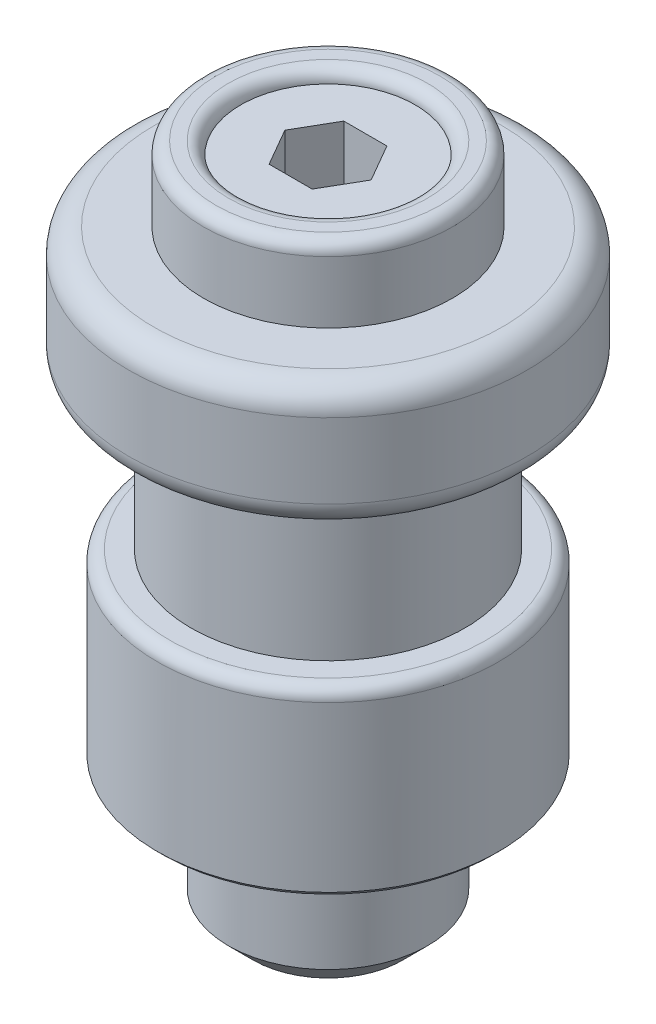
ISO-10303-21;
HEADER;
FILE_DESCRIPTION(('STEP AP214'),'2;1');
FILE_NAME('part.step','',(''),(''),'','','');
FILE_SCHEMA(('AUTOMOTIVE_DESIGN { 1 0 10303 214 1 1 1 1 }'));
ENDSEC;
DATA;
#1=APPLICATION_CONTEXT('core data for automotive mechanical design processes');
#2=APPLICATION_PROTOCOL_DEFINITION('international standard','automotive_design',2000,#1);
#3=PRODUCT_CONTEXT('',#1,'mechanical');
#4=PRODUCT('Part','Part','',(#3));
#5=PRODUCT_RELATED_PRODUCT_CATEGORY('part','',(#4));
#6=PRODUCT_DEFINITION_FORMATION('','',#4);
#7=PRODUCT_DEFINITION_CONTEXT('part definition',#1,'design');
#8=PRODUCT_DEFINITION('design','',#6,#7);
#9=PRODUCT_DEFINITION_SHAPE('','',#8);
#10=(LENGTH_UNIT() NAMED_UNIT(*) SI_UNIT(.MILLI.,.METRE.));
#11=(NAMED_UNIT(*) PLANE_ANGLE_UNIT() SI_UNIT($,.RADIAN.));
#12=(NAMED_UNIT(*) SI_UNIT($,.STERADIAN.) SOLID_ANGLE_UNIT());
#13=UNCERTAINTY_MEASURE_WITH_UNIT(LENGTH_MEASURE(1.E-05),#10,'distance_accuracy_value','');
#14=(GEOMETRIC_REPRESENTATION_CONTEXT(3) GLOBAL_UNCERTAINTY_ASSIGNED_CONTEXT((#13)) GLOBAL_UNIT_ASSIGNED_CONTEXT((#10,
#11,#12)) REPRESENTATION_CONTEXT('',''));
#15=CARTESIAN_POINT('',(0.,0.,0.));
#16=DIRECTION('',(0.,0.,1.));
#17=DIRECTION('',(1.,0.,0.));
#18=AXIS2_PLACEMENT_3D('',#15,#16,#17);
#19=CARTESIAN_POINT('',(0.,7.3,0.));
#20=DIRECTION('',(0.,1.,0.));
#21=DIRECTION('',(0.,0.,1.));
#22=AXIS2_PLACEMENT_3D('',#19,#20,#21);
#23=PLANE('',#22);
#24=CARTESIAN_POINT('',(0.,7.3,0.));
#25=DIRECTION('',(0.,1.,0.));
#26=DIRECTION('',(0.,0.,1.));
#27=AXIS2_PLACEMENT_3D('',#24,#25,#26);
#28=CIRCLE('',#27,5.5);
#29=CARTESIAN_POINT('',(0.,7.3,5.5));
#30=VERTEX_POINT('',#29);
#31=EDGE_CURVE('E177',#30,#30,#28,.F.);
#32=ORIENTED_EDGE('',*,*,#31,.T.);
#33=EDGE_LOOP('',(#32));
#34=FACE_BOUND('',#33,.T.);
#35=CARTESIAN_POINT('',(0.,7.3,0.));
#36=DIRECTION('',(0.,1.,0.));
#37=DIRECTION('',(0.0277589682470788,0.,0.999614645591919));
#38=AXIS2_PLACEMENT_3D('',#35,#36,#37);
#39=CIRCLE('',#38,6.35);
#40=CARTESIAN_POINT('',(0.176269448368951,7.3,6.34755299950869));
#41=VERTEX_POINT('',#40);
#42=EDGE_CURVE('E702',#41,#41,#39,.T.);
#43=ORIENTED_EDGE('',*,*,#42,.T.);
#44=EDGE_LOOP('',(#43));
#45=FACE_BOUND('',#44,.T.);
#46=ADVANCED_FACE('F16',(#34,#45),#23,.T.);
#47=CARTESIAN_POINT('',(-6.5,13.5187900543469,0.));
#48=DIRECTION('',(0.,1.,0.));
#49=DIRECTION('',(0.,0.,1.));
#50=AXIS2_PLACEMENT_3D('',#47,#48,#49);
#51=PLANE('',#50);
#52=CARTESIAN_POINT('',(0.,13.5187900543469,0.));
#53=DIRECTION('',(0.,1.,0.));
#54=DIRECTION('',(0.,0.,1.));
#55=AXIS2_PLACEMENT_3D('',#52,#53,#54);
#56=CIRCLE('',#55,7.);
#57=CARTESIAN_POINT('',(0.,13.5187900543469,7.));
#58=VERTEX_POINT('',#57);
#59=EDGE_CURVE('E151',#58,#58,#56,.F.);
#60=ORIENTED_EDGE('',*,*,#59,.T.);
#61=EDGE_LOOP('',(#60));
#62=FACE_BOUND('',#61,.T.);
#63=CARTESIAN_POINT('',(0.,13.5187900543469,0.));
#64=DIRECTION('',(0.,-1.,0.));
#65=DIRECTION('',(0.,0.,-1.));
#66=AXIS2_PLACEMENT_3D('',#63,#64,#65);
#67=CIRCLE('',#66,6.5);
#68=CARTESIAN_POINT('',(0.,13.5187900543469,-6.5));
#69=VERTEX_POINT('',#68);
#70=EDGE_CURVE('E143',#69,#69,#67,.T.);
#71=ORIENTED_EDGE('',*,*,#70,.F.);
#72=EDGE_LOOP('',(#71));
#73=FACE_BOUND('',#72,.T.);
#74=ADVANCED_FACE('F239',(#62,#73),#51,.F.);
#75=CARTESIAN_POINT('',(0.,12.5187900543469,0.));
#76=DIRECTION('',(0.,-1.,0.));
#77=DIRECTION('',(0.,0.,-1.));
#78=AXIS2_PLACEMENT_3D('',#75,#76,#77);
#79=TOROIDAL_SURFACE('',#78,6.5,1.);
#80=CARTESIAN_POINT('',(0.,12.5187900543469,0.));
#81=DIRECTION('',(0.,-1.,0.));
#82=DIRECTION('',(0.,0.,-1.));
#83=AXIS2_PLACEMENT_3D('',#80,#81,#82);
#84=CIRCLE('',#83,5.5);
#85=CARTESIAN_POINT('',(0.,12.5187900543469,-5.5));
#86=VERTEX_POINT('',#85);
#87=EDGE_CURVE('E147',#86,#86,#84,.T.);
#88=ORIENTED_EDGE('',*,*,#87,.F.);
#89=EDGE_LOOP('',(#88));
#90=FACE_BOUND('',#89,.T.);
#91=ORIENTED_EDGE('',*,*,#70,.T.);
#92=EDGE_LOOP('',(#91));
#93=FACE_BOUND('',#92,.T.);
#94=ADVANCED_FACE('F233',(#90,#93),#79,.F.);
#95=CARTESIAN_POINT('',(0.,3.5187900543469,0.));
#96=DIRECTION('',(0.,-1.,0.));
#97=DIRECTION('',(0.,0.,-1.));
#98=AXIS2_PLACEMENT_3D('',#95,#96,#97);
#99=CYLINDRICAL_SURFACE('',#98,5.5);
#100=ORIENTED_EDGE('',*,*,#31,.F.);
#101=EDGE_LOOP('',(#100));
#102=FACE_BOUND('',#101,.T.);
#103=ORIENTED_EDGE('',*,*,#87,.T.);
#104=EDGE_LOOP('',(#103));
#105=FACE_BOUND('',#104,.T.);
#106=ADVANCED_FACE('F229',(#102,#105),#99,.T.);
#107=CARTESIAN_POINT('',(0.,14.5187900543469,0.));
#108=DIRECTION('',(0.,1.,0.));
#109=DIRECTION('',(0.,0.,1.));
#110=AXIS2_PLACEMENT_3D('',#107,#108,#109);
#111=TOROIDAL_SURFACE('',#110,7.,1.);
#112=CARTESIAN_POINT('',(0.,14.5187900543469,0.));
#113=DIRECTION('',(0.,1.,0.));
#114=DIRECTION('',(0.,0.,1.));
#115=AXIS2_PLACEMENT_3D('',#112,#113,#114);
#116=CIRCLE('',#115,8.);
#117=CARTESIAN_POINT('',(0.,14.5187900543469,8.));
#118=VERTEX_POINT('',#117);
#119=EDGE_CURVE('E155',#118,#118,#116,.T.);
#120=ORIENTED_EDGE('',*,*,#119,.F.);
#121=EDGE_LOOP('',(#120));
#122=FACE_BOUND('',#121,.T.);
#123=ORIENTED_EDGE('',*,*,#59,.F.);
#124=EDGE_LOOP('',(#123));
#125=FACE_BOUND('',#124,.T.);
#126=ADVANCED_FACE('F232',(#122,#125),#111,.T.);
#127=CARTESIAN_POINT('',(0.,3.5187900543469,0.));
#128=DIRECTION('',(0.,-1.,0.));
#129=DIRECTION('',(0.,0.,-1.));
#130=AXIS2_PLACEMENT_3D('',#127,#128,#129);
#131=CYLINDRICAL_SURFACE('',#130,8.);
#132=CARTESIAN_POINT('',(0.,17.5187900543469,0.));
#133=DIRECTION('',(0.,-1.,0.));
#134=DIRECTION('',(0.,0.,-1.));
#135=AXIS2_PLACEMENT_3D('',#132,#133,#134);
#136=CIRCLE('',#135,8.);
#137=CARTESIAN_POINT('',(0.,17.5187900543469,-8.));
#138=VERTEX_POINT('',#137);
#139=EDGE_CURVE('E159',#138,#138,#136,.T.);
#140=ORIENTED_EDGE('',*,*,#139,.T.);
#141=EDGE_LOOP('',(#140));
#142=FACE_BOUND('',#141,.T.);
#143=ORIENTED_EDGE('',*,*,#119,.T.);
#144=EDGE_LOOP('',(#143));
#145=FACE_BOUND('',#144,.T.);
#146=ADVANCED_FACE('F255',(#142,#145),#131,.T.);
#147=CARTESIAN_POINT('',(0.,17.5187900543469,0.));
#148=DIRECTION('',(0.,-1.,0.));
#149=DIRECTION('',(0.,0.,-1.));
#150=AXIS2_PLACEMENT_3D('',#147,#148,#149);
#151=TOROIDAL_SURFACE('',#150,7.,1.);
#152=CARTESIAN_POINT('',(0.,18.5187900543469,0.));
#153=DIRECTION('',(0.,-1.,0.));
#154=DIRECTION('',(0.,0.,-1.));
#155=AXIS2_PLACEMENT_3D('',#152,#153,#154);
#156=CIRCLE('',#155,7.);
#157=CARTESIAN_POINT('',(0.,18.5187900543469,-7.));
#158=VERTEX_POINT('',#157);
#159=EDGE_CURVE('E163',#158,#158,#156,.F.);
#160=ORIENTED_EDGE('',*,*,#159,.F.);
#161=EDGE_LOOP('',(#160));
#162=FACE_BOUND('',#161,.T.);
#163=ORIENTED_EDGE('',*,*,#139,.F.);
#164=EDGE_LOOP('',(#163));
#165=FACE_BOUND('',#164,.T.);
#166=ADVANCED_FACE('F257',(#162,#165),#151,.T.);
#167=CARTESIAN_POINT('',(0.,18.5187900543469,0.));
#168=DIRECTION('',(0.,1.,0.));
#169=DIRECTION('',(0.,0.,1.));
#170=AXIS2_PLACEMENT_3D('',#167,#168,#169);
#171=PLANE('',#170);
#172=CARTESIAN_POINT('',(0.,18.5187900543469,0.));
#173=DIRECTION('',(0.,1.,0.));
#174=DIRECTION('',(0.,0.,1.));
#175=AXIS2_PLACEMENT_3D('',#172,#173,#174);
#176=CIRCLE('',#175,5.);
#177=CARTESIAN_POINT('',(0.,18.5187900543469,5.));
#178=VERTEX_POINT('',#177);
#179=EDGE_CURVE('E9',#178,#178,#176,.T.);
#180=ORIENTED_EDGE('',*,*,#179,.F.);
#181=EDGE_LOOP('',(#180));
#182=FACE_BOUND('',#181,.T.);
#183=ORIENTED_EDGE('',*,*,#159,.T.);
#184=EDGE_LOOP('',(#183));
#185=FACE_BOUND('',#184,.T.);
#186=ADVANCED_FACE('F265',(#182,#185),#171,.T.);
#187=CARTESIAN_POINT('',(0.,17.5,0.));
#188=DIRECTION('',(0.,-1.,0.));
#189=DIRECTION('',(0.,0.,-1.));
#190=AXIS2_PLACEMENT_3D('',#187,#188,#189);
#191=CYLINDRICAL_SURFACE('',#190,5.);
#192=ORIENTED_EDGE('',*,*,#179,.T.);
#193=EDGE_LOOP('',(#192));
#194=FACE_BOUND('',#193,.T.);
#195=CARTESIAN_POINT('',(0.,21.,0.));
#196=DIRECTION('',(0.,1.,0.));
#197=DIRECTION('',(0.,0.,1.));
#198=AXIS2_PLACEMENT_3D('',#195,#196,#197);
#199=CIRCLE('',#198,5.);
#200=CARTESIAN_POINT('',(0.,21.,5.));
#201=VERTEX_POINT('',#200);
#202=EDGE_CURVE('E131',#201,#201,#199,.F.);
#203=ORIENTED_EDGE('',*,*,#202,.T.);
#204=EDGE_LOOP('',(#203));
#205=FACE_BOUND('',#204,.T.);
#206=ADVANCED_FACE('F290',(#194,#205),#191,.T.);
#207=CARTESIAN_POINT('',(5.,21.5,0.));
#208=DIRECTION('',(0.,1.,0.));
#209=DIRECTION('',(0.,0.,1.));
#210=AXIS2_PLACEMENT_3D('',#207,#208,#209);
#211=PLANE('',#210);
#212=CARTESIAN_POINT('',(0.,21.5,0.));
#213=DIRECTION('',(0.,1.,0.));
#214=DIRECTION('',(0.,0.,1.));
#215=AXIS2_PLACEMENT_3D('',#212,#213,#214);
#216=CIRCLE('',#215,4.);
#217=CARTESIAN_POINT('',(0.,21.5,4.));
#218=VERTEX_POINT('',#217);
#219=EDGE_CURVE('E122',#218,#218,#216,.F.);
#220=ORIENTED_EDGE('',*,*,#219,.T.);
#221=EDGE_LOOP('',(#220));
#222=FACE_BOUND('',#221,.T.);
#223=CARTESIAN_POINT('',(0.,21.5,0.));
#224=DIRECTION('',(0.,1.,0.));
#225=DIRECTION('',(0.,0.,1.));
#226=AXIS2_PLACEMENT_3D('',#223,#224,#225);
#227=CIRCLE('',#226,4.5);
#228=CARTESIAN_POINT('',(0.,21.5,4.5));
#229=VERTEX_POINT('',#228);
#230=EDGE_CURVE('E118',#229,#229,#227,.T.);
#231=ORIENTED_EDGE('',*,*,#230,.T.);
#232=EDGE_LOOP('',(#231));
#233=FACE_BOUND('',#232,.T.);
#234=ADVANCED_FACE('F520',(#222,#233),#211,.T.);
#235=CARTESIAN_POINT('',(0.,21.,0.));
#236=DIRECTION('',(0.,1.,0.));
#237=DIRECTION('',(0.,0.,1.));
#238=AXIS2_PLACEMENT_3D('',#235,#236,#237);
#239=TOROIDAL_SURFACE('',#238,4.,0.5);
#240=CARTESIAN_POINT('',(0.,21.,0.));
#241=DIRECTION('',(0.,1.,0.));
#242=DIRECTION('',(0.,0.,1.));
#243=AXIS2_PLACEMENT_3D('',#240,#241,#242);
#244=CIRCLE('',#243,3.5);
#245=CARTESIAN_POINT('',(0.,21.,3.5));
#246=VERTEX_POINT('',#245);
#247=EDGE_CURVE('E127',#246,#246,#244,.T.);
#248=ORIENTED_EDGE('',*,*,#247,.F.);
#249=EDGE_LOOP('',(#248));
#250=FACE_BOUND('',#249,.T.);
#251=ORIENTED_EDGE('',*,*,#219,.F.);
#252=EDGE_LOOP('',(#251));
#253=FACE_BOUND('',#252,.T.);
#254=ADVANCED_FACE('F511',(#250,#253),#239,.T.);
#255=CARTESIAN_POINT('',(0.,21.,0.));
#256=DIRECTION('',(0.,1.,0.));
#257=DIRECTION('',(0.,0.,1.));
#258=AXIS2_PLACEMENT_3D('',#255,#256,#257);
#259=TOROIDAL_SURFACE('',#258,4.5,0.5);
#260=ORIENTED_EDGE('',*,*,#230,.F.);
#261=EDGE_LOOP('',(#260));
#262=FACE_BOUND('',#261,.T.);
#263=ORIENTED_EDGE('',*,*,#202,.F.);
#264=EDGE_LOOP('',(#263));
#265=FACE_BOUND('',#264,.T.);
#266=ADVANCED_FACE('F286',(#262,#265),#259,.T.);
#267=CARTESIAN_POINT('',(0.,21.,0.));
#268=DIRECTION('',(0.,-1.,0.));
#269=DIRECTION('',(0.,0.,-1.));
#270=AXIS2_PLACEMENT_3D('',#267,#268,#269);
#271=PLANE('',#270);
#272=ORIENTED_EDGE('',*,*,#247,.T.);
#273=EDGE_LOOP('',(#272));
#274=FACE_BOUND('',#273,.T.);
#275=DIRECTION('',(1.00000000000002,0.,0.));
#276=VECTOR('',#275,1.);
#277=CARTESIAN_POINT('',(-0.866025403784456,21.,-1.50000000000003));
#278=LINE('',#277,#276);
#279=CARTESIAN_POINT('',(0.866025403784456,21.,-1.50000000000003));
#280=VERTEX_POINT('',#279);
#281=CARTESIAN_POINT('',(-0.866025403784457,21.,-1.50000000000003));
#282=VERTEX_POINT('',#281);
#283=EDGE_CURVE('E42',#280,#282,#278,.F.);
#284=ORIENTED_EDGE('',*,*,#283,.F.);
#285=DIRECTION('',(-0.500000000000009,0.,-0.866025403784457));
#286=VECTOR('',#285,1.);
#287=CARTESIAN_POINT('',(0.866025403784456,21.,-1.50000000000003));
#288=LINE('',#287,#286);
#289=CARTESIAN_POINT('',(1.73205080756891,21.,0.));
#290=VERTEX_POINT('',#289);
#291=EDGE_CURVE('E78',#290,#280,#288,.T.);
#292=ORIENTED_EDGE('',*,*,#291,.F.);
#293=DIRECTION('',(0.500000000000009,0.,-0.866025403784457));
#294=VECTOR('',#293,1.);
#295=CARTESIAN_POINT('',(1.73205080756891,21.,0.));
#296=LINE('',#295,#294);
#297=CARTESIAN_POINT('',(0.866025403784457,21.,1.50000000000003));
#298=VERTEX_POINT('',#297);
#299=EDGE_CURVE('E71',#298,#290,#296,.T.);
#300=ORIENTED_EDGE('',*,*,#299,.F.);
#301=DIRECTION('',(1.00000000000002,0.,0.));
#302=VECTOR('',#301,1.);
#303=CARTESIAN_POINT('',(0.866025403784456,21.,1.50000000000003));
#304=LINE('',#303,#302);
#305=CARTESIAN_POINT('',(-0.866025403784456,21.,1.50000000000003));
#306=VERTEX_POINT('',#305);
#307=EDGE_CURVE('E75',#306,#298,#304,.T.);
#308=ORIENTED_EDGE('',*,*,#307,.F.);
#309=DIRECTION('',(0.500000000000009,0.,0.866025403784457));
#310=VECTOR('',#309,1.);
#311=CARTESIAN_POINT('',(-0.866025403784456,21.,1.50000000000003));
#312=LINE('',#311,#310);
#313=CARTESIAN_POINT('',(-1.73205080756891,21.,0.));
#314=VERTEX_POINT('',#313);
#315=EDGE_CURVE('E114',#314,#306,#312,.T.);
#316=ORIENTED_EDGE('',*,*,#315,.F.);
#317=DIRECTION('',(-0.50000000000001,0.,0.866025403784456));
#318=VECTOR('',#317,1.);
#319=CARTESIAN_POINT('',(-0.866025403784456,21.,-1.50000000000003));
#320=LINE('',#319,#318);
#321=EDGE_CURVE('E123',#282,#314,#320,.T.);
#322=ORIENTED_EDGE('',*,*,#321,.F.);
#323=EDGE_LOOP('',(#284,#292,#300,#308,#316,#322));
#324=FACE_BOUND('',#323,.T.);
#325=ADVANCED_FACE('F73',(#274,#324),#271,.F.);
#326=CARTESIAN_POINT('',(1.73205080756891,18.,0.));
#327=DIRECTION('',(-0.866025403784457,0.,-0.500000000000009));
#328=DIRECTION('',(0.500000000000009,0.,-0.866025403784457));
#329=AXIS2_PLACEMENT_3D('',#326,#327,#328);
#330=PLANE('',#329);
#331=DIRECTION('',(0.500000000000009,0.,-0.866025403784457));
#332=VECTOR('',#331,1.);
#333=CARTESIAN_POINT('',(1.73205080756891,18.,0.));
#334=LINE('',#333,#332);
#335=CARTESIAN_POINT('',(1.73205080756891,18.,0.));
#336=VERTEX_POINT('',#335);
#337=CARTESIAN_POINT('',(0.866025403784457,18.,1.50000000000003));
#338=VERTEX_POINT('',#337);
#339=EDGE_CURVE('E83',#336,#338,#334,.F.);
#340=ORIENTED_EDGE('',*,*,#339,.T.);
#341=DIRECTION('',(0.,1.,0.));
#342=VECTOR('',#341,1.);
#343=CARTESIAN_POINT('',(0.866025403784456,18.,1.50000000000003));
#344=LINE('',#343,#342);
#345=EDGE_CURVE('E88',#298,#338,#344,.F.);
#346=ORIENTED_EDGE('',*,*,#345,.F.);
#347=ORIENTED_EDGE('',*,*,#299,.T.);
#348=DIRECTION('',(0.,-1.,0.));
#349=VECTOR('',#348,1.);
#350=CARTESIAN_POINT('',(1.73205080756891,18.,0.));
#351=LINE('',#350,#349);
#352=EDGE_CURVE('E112',#336,#290,#351,.F.);
#353=ORIENTED_EDGE('',*,*,#352,.F.);
#354=EDGE_LOOP('',(#340,#346,#347,#353));
#355=FACE_BOUND('',#354,.T.);
#356=ADVANCED_FACE('F89',(#355),#330,.T.);
#357=CARTESIAN_POINT('',(0.866025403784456,18.,1.50000000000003));
#358=DIRECTION('',(0.,0.,-1.00000000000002));
#359=DIRECTION('',(0.,1.,0.));
#360=AXIS2_PLACEMENT_3D('',#357,#358,#359);
#361=PLANE('',#360);
#362=DIRECTION('',(1.00000000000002,0.,0.));
#363=VECTOR('',#362,1.);
#364=CARTESIAN_POINT('',(0.,18.,1.50000000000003));
#365=LINE('',#364,#363);
#366=CARTESIAN_POINT('',(-0.866025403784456,18.,1.50000000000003));
#367=VERTEX_POINT('',#366);
#368=EDGE_CURVE('E93',#338,#367,#365,.F.);
#369=ORIENTED_EDGE('',*,*,#368,.T.);
#370=DIRECTION('',(0.,-1.,0.));
#371=VECTOR('',#370,1.);
#372=CARTESIAN_POINT('',(-0.866025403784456,18.,1.50000000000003));
#373=LINE('',#372,#371);
#374=EDGE_CURVE('E97',#306,#367,#373,.T.);
#375=ORIENTED_EDGE('',*,*,#374,.F.);
#376=ORIENTED_EDGE('',*,*,#307,.T.);
#377=ORIENTED_EDGE('',*,*,#345,.T.);
#378=EDGE_LOOP('',(#369,#375,#376,#377));
#379=FACE_BOUND('',#378,.T.);
#380=ADVANCED_FACE('F95',(#379),#361,.T.);
#381=CARTESIAN_POINT('',(0.866025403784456,18.,-1.50000000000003));
#382=DIRECTION('',(-0.866025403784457,0.,0.500000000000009));
#383=DIRECTION('',(-0.500000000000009,0.,-0.866025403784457));
#384=AXIS2_PLACEMENT_3D('',#381,#382,#383);
#385=PLANE('',#384);
#386=DIRECTION('',(-0.500000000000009,0.,-0.866025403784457));
#387=VECTOR('',#386,1.);
#388=CARTESIAN_POINT('',(0.866025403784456,18.,-1.50000000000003));
#389=LINE('',#388,#387);
#390=CARTESIAN_POINT('',(0.866025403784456,18.,-1.50000000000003));
#391=VERTEX_POINT('',#390);
#392=EDGE_CURVE('E108',#391,#336,#389,.F.);
#393=ORIENTED_EDGE('',*,*,#392,.T.);
#394=ORIENTED_EDGE('',*,*,#352,.T.);
#395=ORIENTED_EDGE('',*,*,#291,.T.);
#396=DIRECTION('',(0.,-1.,0.));
#397=VECTOR('',#396,1.);
#398=CARTESIAN_POINT('',(0.866025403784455,18.,-1.50000000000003));
#399=LINE('',#398,#397);
#400=EDGE_CURVE('E666',#391,#280,#399,.F.);
#401=ORIENTED_EDGE('',*,*,#400,.F.);
#402=EDGE_LOOP('',(#393,#394,#395,#401));
#403=FACE_BOUND('',#402,.T.);
#404=ADVANCED_FACE('F479',(#403),#385,.T.);
#405=CARTESIAN_POINT('',(-0.866025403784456,18.,1.50000000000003));
#406=DIRECTION('',(0.866025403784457,0.,-0.500000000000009));
#407=DIRECTION('',(0.500000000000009,0.,0.866025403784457));
#408=AXIS2_PLACEMENT_3D('',#405,#406,#407);
#409=PLANE('',#408);
#410=DIRECTION('',(-0.50000000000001,0.,-0.866025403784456));
#411=VECTOR('',#410,1.);
#412=CARTESIAN_POINT('',(-1.29903810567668,18.,0.750000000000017));
#413=LINE('',#412,#411);
#414=CARTESIAN_POINT('',(-1.73205080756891,17.9999999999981,0.));
#415=VERTEX_POINT('',#414);
#416=EDGE_CURVE('E670',#367,#415,#413,.T.);
#417=ORIENTED_EDGE('',*,*,#416,.T.);
#418=DIRECTION('',(0.,-1.,0.));
#419=VECTOR('',#418,1.);
#420=CARTESIAN_POINT('',(-1.73205080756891,18.,0.));
#421=LINE('',#420,#419);
#422=EDGE_CURVE('E676',#314,#415,#421,.T.);
#423=ORIENTED_EDGE('',*,*,#422,.F.);
#424=ORIENTED_EDGE('',*,*,#315,.T.);
#425=ORIENTED_EDGE('',*,*,#374,.T.);
#426=EDGE_LOOP('',(#417,#423,#424,#425));
#427=FACE_BOUND('',#426,.T.);
#428=ADVANCED_FACE('F471',(#427),#409,.T.);
#429=CARTESIAN_POINT('',(-0.866025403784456,18.,-1.50000000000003));
#430=DIRECTION('',(0.,0.,1.00000000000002));
#431=DIRECTION('',(0.,-1.,0.));
#432=AXIS2_PLACEMENT_3D('',#429,#430,#431);
#433=PLANE('',#432);
#434=DIRECTION('',(1.00000000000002,0.,0.));
#435=VECTOR('',#434,1.);
#436=CARTESIAN_POINT('',(-0.866025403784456,18.,-1.50000000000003));
#437=LINE('',#436,#435);
#438=CARTESIAN_POINT('',(-0.866025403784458,18.,-1.50000000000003));
#439=VERTEX_POINT('',#438);
#440=EDGE_CURVE('E668',#439,#391,#437,.T.);
#441=ORIENTED_EDGE('',*,*,#440,.T.);
#442=ORIENTED_EDGE('',*,*,#400,.T.);
#443=ORIENTED_EDGE('',*,*,#283,.T.);
#444=DIRECTION('',(0.,-1.,0.));
#445=VECTOR('',#444,1.);
#446=CARTESIAN_POINT('',(-0.866025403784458,18.,-1.50000000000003));
#447=LINE('',#446,#445);
#448=EDGE_CURVE('E682',#439,#282,#447,.F.);
#449=ORIENTED_EDGE('',*,*,#448,.F.);
#450=EDGE_LOOP('',(#441,#442,#443,#449));
#451=FACE_BOUND('',#450,.T.);
#452=ADVANCED_FACE('F462',(#451),#433,.T.);
#453=CARTESIAN_POINT('',(-1.73205080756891,18.,0.));
#454=DIRECTION('',(0.866025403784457,0.,0.500000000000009));
#455=DIRECTION('',(-0.500000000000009,0.,0.866025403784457));
#456=AXIS2_PLACEMENT_3D('',#453,#454,#455);
#457=PLANE('',#456);
#458=DIRECTION('',(-0.500000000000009,0.,0.866025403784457));
#459=VECTOR('',#458,1.);
#460=CARTESIAN_POINT('',(-1.73205080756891,18.,0.));
#461=LINE('',#460,#459);
#462=EDGE_CURVE('E33',#415,#439,#461,.F.);
#463=ORIENTED_EDGE('',*,*,#462,.T.);
#464=ORIENTED_EDGE('',*,*,#448,.T.);
#465=ORIENTED_EDGE('',*,*,#321,.T.);
#466=ORIENTED_EDGE('',*,*,#422,.T.);
#467=EDGE_LOOP('',(#463,#464,#465,#466));
#468=FACE_BOUND('',#467,.T.);
#469=ADVANCED_FACE('F283',(#468),#457,.T.);
#470=CARTESIAN_POINT('',(0.,17.9999999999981,0.));
#471=DIRECTION('',(0.,-1.,0.));
#472=DIRECTION('',(0.,0.,-1.));
#473=AXIS2_PLACEMENT_3D('',#470,#471,#472);
#474=PLANE('',#473);
#475=ORIENTED_EDGE('',*,*,#416,.F.);
#476=ORIENTED_EDGE('',*,*,#368,.F.);
#477=ORIENTED_EDGE('',*,*,#339,.F.);
#478=ORIENTED_EDGE('',*,*,#392,.F.);
#479=ORIENTED_EDGE('',*,*,#440,.F.);
#480=ORIENTED_EDGE('',*,*,#462,.F.);
#481=EDGE_LOOP('',(#475,#476,#477,#478,#479,#480));
#482=FACE_BOUND('',#481,.T.);
#483=ADVANCED_FACE('F279',(#482),#474,.F.);
#484=CARTESIAN_POINT('',(0.,0.,0.));
#485=DIRECTION('',(0.,-1.,0.));
#486=DIRECTION('',(-0.0277589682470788,0.,-0.999614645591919));
#487=AXIS2_PLACEMENT_3D('',#484,#485,#486);
#488=CYLINDRICAL_SURFACE('',#487,6.85);
#489=CARTESIAN_POINT('',(0.,0.2,0.));
#490=DIRECTION('',(0.,-1.,0.));
#491=DIRECTION('',(-0.0277589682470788,0.,-0.999614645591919));
#492=AXIS2_PLACEMENT_3D('',#489,#490,#491);
#493=CIRCLE('',#492,6.85);
#494=CARTESIAN_POINT('',(-0.190148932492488,0.2,-6.84736032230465));
#495=VERTEX_POINT('',#494);
#496=EDGE_CURVE('E84',#495,#495,#493,.F.);
#497=ORIENTED_EDGE('',*,*,#496,.T.);
#498=EDGE_LOOP('',(#497));
#499=FACE_BOUND('',#498,.T.);
#500=CARTESIAN_POINT('',(0.,6.8,0.));
#501=DIRECTION('',(0.,1.,0.));
#502=DIRECTION('',(0.0277589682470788,0.,0.999614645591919));
#503=AXIS2_PLACEMENT_3D('',#500,#501,#502);
#504=CIRCLE('',#503,6.85);
#505=CARTESIAN_POINT('',(0.190148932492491,6.8,6.84736032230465));
#506=VERTEX_POINT('',#505);
#507=EDGE_CURVE('E706',#506,#506,#504,.F.);
#508=ORIENTED_EDGE('',*,*,#507,.T.);
#509=EDGE_LOOP('',(#508));
#510=FACE_BOUND('',#509,.T.);
#511=ADVANCED_FACE('F282',(#499,#510),#488,.T.);
#512=CARTESIAN_POINT('',(0.,6.8,0.));
#513=DIRECTION('',(0.,1.,0.));
#514=DIRECTION('',(0.0277589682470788,0.,0.999614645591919));
#515=AXIS2_PLACEMENT_3D('',#512,#513,#514);
#516=TOROIDAL_SURFACE('',#515,6.35,0.5);
#517=ORIENTED_EDGE('',*,*,#42,.F.);
#518=EDGE_LOOP('',(#517));
#519=FACE_BOUND('',#518,.T.);
#520=ORIENTED_EDGE('',*,*,#507,.F.);
#521=EDGE_LOOP('',(#520));
#522=FACE_BOUND('',#521,.T.);
#523=ADVANCED_FACE('F435',(#519,#522),#516,.T.);
#524=CARTESIAN_POINT('',(0.,0.,0.));
#525=DIRECTION('',(0.,1.,0.));
#526=DIRECTION('',(0.0277589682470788,0.,0.999614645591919));
#527=AXIS2_PLACEMENT_3D('',#524,#525,#526);
#528=CONICAL_SURFACE('',#527,6.65,0.785398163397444);
#529=ORIENTED_EDGE('',*,*,#496,.F.);
#530=EDGE_LOOP('',(#529));
#531=FACE_BOUND('',#530,.T.);
#532=CARTESIAN_POINT('',(0.,0.,0.));
#533=DIRECTION('',(0.,-1.,0.));
#534=DIRECTION('',(-0.0277589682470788,0.,-0.999614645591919));
#535=AXIS2_PLACEMENT_3D('',#532,#533,#534);
#536=CIRCLE('',#535,6.65);
#537=CARTESIAN_POINT('',(-0.184597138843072,0.,-6.64743739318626));
#538=VERTEX_POINT('',#537);
#539=EDGE_CURVE('E698',#538,#538,#536,.T.);
#540=ORIENTED_EDGE('',*,*,#539,.F.);
#541=EDGE_LOOP('',(#540));
#542=FACE_BOUND('',#541,.T.);
#543=ADVANCED_FACE('F429',(#531,#542),#528,.T.);
#544=CARTESIAN_POINT('',(1.53602976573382,8.2,0.));
#545=DIRECTION('',(0.,-1.,0.));
#546=DIRECTION('',(0.,0.,-1.));
#547=AXIS2_PLACEMENT_3D('',#544,#545,#546);
#548=PLANE('',#547);
#549=CARTESIAN_POINT('',(0.,8.2,0.));
#550=DIRECTION('',(0.,-1.,0.));
#551=DIRECTION('',(0.,0.,-1.));
#552=AXIS2_PLACEMENT_3D('',#549,#550,#551);
#553=CIRCLE('',#552,1.25594675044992);
#554=CARTESIAN_POINT('',(0.,8.2,-1.25594675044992));
#555=VERTEX_POINT('',#554);
#556=EDGE_CURVE('E139',#555,#555,#553,.T.);
#557=ORIENTED_EDGE('',*,*,#556,.T.);
#558=EDGE_LOOP('',(#557));
#559=FACE_BOUND('',#558,.T.);
#560=ADVANCED_FACE('F434',(#559),#548,.T.);
#561=CARTESIAN_POINT('',(0.,7.8,0.));
#562=DIRECTION('',(0.,-1.,0.));
#563=DIRECTION('',(0.,0.,-1.));
#564=AXIS2_PLACEMENT_3D('',#561,#562,#563);
#565=TOROIDAL_SURFACE('',#564,1.25594675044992,0.4);
#566=ORIENTED_EDGE('',*,*,#556,.F.);
#567=EDGE_LOOP('',(#566));
#568=FACE_BOUND('',#567,.T.);
#569=CARTESIAN_POINT('',(0.,7.93680805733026,0.));
#570=DIRECTION('',(0.,-1.,0.));
#571=DIRECTION('',(0.,0.,-1.));
#572=AXIS2_PLACEMENT_3D('',#569,#570,#571);
#573=CIRCLE('',#572,1.63182379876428);
#574=CARTESIAN_POINT('',(0.,7.93680805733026,-1.63182379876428));
#575=VERTEX_POINT('',#574);
#576=EDGE_CURVE('E135',#575,#575,#573,.F.);
#577=ORIENTED_EDGE('',*,*,#576,.F.);
#578=EDGE_LOOP('',(#577));
#579=FACE_BOUND('',#578,.T.);
#580=ADVANCED_FACE('F542',(#568,#579),#565,.F.);
#581=CARTESIAN_POINT('',(0.,7.2,0.));
#582=DIRECTION('',(0.,-1.,0.));
#583=DIRECTION('',(0.,0.,-1.));
#584=AXIS2_PLACEMENT_3D('',#581,#582,#583);
#585=CONICAL_SURFACE('',#584,1.9,0.34906585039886);
#586=ORIENTED_EDGE('',*,*,#576,.T.);
#587=EDGE_LOOP('',(#586));
#588=FACE_BOUND('',#587,.T.);
#589=CARTESIAN_POINT('',(0.,7.2,0.));
#590=DIRECTION('',(0.,-1.,0.));
#591=DIRECTION('',(0.,0.,-1.));
#592=AXIS2_PLACEMENT_3D('',#589,#590,#591);
#593=CIRCLE('',#592,1.9);
#594=CARTESIAN_POINT('',(0.,7.2,-1.9));
#595=VERTEX_POINT('',#594);
#596=EDGE_CURVE('E172',#595,#595,#593,.T.);
#597=ORIENTED_EDGE('',*,*,#596,.T.);
#598=EDGE_LOOP('',(#597));
#599=FACE_BOUND('',#598,.T.);
#600=ADVANCED_FACE('F277',(#588,#599),#585,.F.);
#601=CARTESIAN_POINT('',(0.,7.2,0.));
#602=DIRECTION('',(0.,-1.,0.));
#603=DIRECTION('',(0.,0.,-1.));
#604=AXIS2_PLACEMENT_3D('',#601,#602,#603);
#605=PLANE('',#604);
#606=ORIENTED_EDGE('',*,*,#596,.F.);
#607=EDGE_LOOP('',(#606));
#608=FACE_BOUND('',#607,.T.);
#609=CARTESIAN_POINT('',(0.,7.2,0.));
#610=DIRECTION('',(0.,-1.,0.));
#611=DIRECTION('',(0.,0.,-1.));
#612=AXIS2_PLACEMENT_3D('',#609,#610,#611);
#613=CIRCLE('',#612,2.1);
#614=CARTESIAN_POINT('',(0.,7.2,-2.1));
#615=VERTEX_POINT('',#614);
#616=EDGE_CURVE('E209',#615,#615,#613,.T.);
#617=ORIENTED_EDGE('',*,*,#616,.T.);
#618=EDGE_LOOP('',(#617));
#619=FACE_BOUND('',#618,.T.);
#620=ADVANCED_FACE('F273',(#608,#619),#605,.T.);
#621=CARTESIAN_POINT('',(0.,-6.,0.));
#622=DIRECTION('',(0.,-1.,0.));
#623=DIRECTION('',(0.,0.,-1.));
#624=AXIS2_PLACEMENT_3D('',#621,#622,#623);
#625=CYLINDRICAL_SURFACE('',#624,2.1);
#626=ORIENTED_EDGE('',*,*,#616,.F.);
#627=EDGE_LOOP('',(#626));
#628=FACE_BOUND('',#627,.T.);
#629=CARTESIAN_POINT('',(0.,4.5,0.));
#630=DIRECTION('',(0.,-1.,0.));
#631=DIRECTION('',(0.,0.,-1.));
#632=AXIS2_PLACEMENT_3D('',#629,#630,#631);
#633=CIRCLE('',#632,2.1);
#634=CARTESIAN_POINT('',(0.,4.5,-2.1));
#635=VERTEX_POINT('',#634);
#636=EDGE_CURVE('E185',#635,#635,#633,.T.);
#637=ORIENTED_EDGE('',*,*,#636,.T.);
#638=EDGE_LOOP('',(#637));
#639=FACE_BOUND('',#638,.T.);
#640=ADVANCED_FACE('F276',(#628,#639),#625,.F.);
#641=CARTESIAN_POINT('',(-2.1,4.5,0.));
#642=DIRECTION('',(0.,1.,0.));
#643=DIRECTION('',(0.,0.,1.));
#644=AXIS2_PLACEMENT_3D('',#641,#642,#643);
#645=PLANE('',#644);
#646=CARTESIAN_POINT('',(0.,4.5,0.));
#647=DIRECTION('',(0.,-1.,0.));
#648=DIRECTION('',(0.,0.,-1.));
#649=AXIS2_PLACEMENT_3D('',#646,#647,#648);
#650=CIRCLE('',#649,1.9);
#651=CARTESIAN_POINT('',(0.,4.5,-1.9));
#652=VERTEX_POINT('',#651);
#653=EDGE_CURVE('E181',#652,#652,#650,.T.);
#654=ORIENTED_EDGE('',*,*,#653,.T.);
#655=EDGE_LOOP('',(#654));
#656=FACE_BOUND('',#655,.T.);
#657=ORIENTED_EDGE('',*,*,#636,.F.);
#658=EDGE_LOOP('',(#657));
#659=FACE_BOUND('',#658,.T.);
#660=ADVANCED_FACE('F304',(#656,#659),#645,.T.);
#661=CARTESIAN_POINT('',(0.,-6.,0.));
#662=DIRECTION('',(0.,-1.,0.));
#663=DIRECTION('',(0.,0.,-1.));
#664=AXIS2_PLACEMENT_3D('',#661,#662,#663);
#665=CYLINDRICAL_SURFACE('',#664,1.9);
#666=CARTESIAN_POINT('',(0.,3.1,0.));
#667=DIRECTION('',(0.,-1.,0.));
#668=DIRECTION('',(0.,0.,-1.));
#669=AXIS2_PLACEMENT_3D('',#666,#667,#668);
#670=CIRCLE('',#669,1.9);
#671=CARTESIAN_POINT('',(0.,3.1,-1.9));
#672=VERTEX_POINT('',#671);
#673=EDGE_CURVE('E197',#672,#672,#670,.T.);
#674=ORIENTED_EDGE('',*,*,#673,.T.);
#675=EDGE_LOOP('',(#674));
#676=FACE_BOUND('',#675,.T.);
#677=ORIENTED_EDGE('',*,*,#653,.F.);
#678=EDGE_LOOP('',(#677));
#679=FACE_BOUND('',#678,.T.);
#680=ADVANCED_FACE('F307',(#676,#679),#665,.F.);
#681=CARTESIAN_POINT('',(0.,2.88161785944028,0.));
#682=DIRECTION('',(0.,-1.,0.));
#683=DIRECTION('',(0.,0.,-1.));
#684=AXIS2_PLACEMENT_3D('',#681,#682,#683);
#685=CONICAL_SURFACE('',#684,2.5,1.22173047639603);
#686=ORIENTED_EDGE('',*,*,#673,.F.);
#687=EDGE_LOOP('',(#686));
#688=FACE_BOUND('',#687,.T.);
#689=CARTESIAN_POINT('',(0.,2.88161785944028,0.));
#690=DIRECTION('',(0.,-1.,0.));
#691=DIRECTION('',(0.,0.,-1.));
#692=AXIS2_PLACEMENT_3D('',#689,#690,#691);
#693=CIRCLE('',#692,2.5);
#694=CARTESIAN_POINT('',(0.,2.88161785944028,-2.5));
#695=VERTEX_POINT('',#694);
#696=EDGE_CURVE('E193',#695,#695,#693,.T.);
#697=ORIENTED_EDGE('',*,*,#696,.T.);
#698=EDGE_LOOP('',(#697));
#699=FACE_BOUND('',#698,.T.);
#700=ADVANCED_FACE('F322',(#688,#699),#685,.F.);
#701=CARTESIAN_POINT('',(0.,-6.,0.));
#702=DIRECTION('',(0.,-1.,0.));
#703=DIRECTION('',(0.,0.,-1.));
#704=AXIS2_PLACEMENT_3D('',#701,#702,#703);
#705=CYLINDRICAL_SURFACE('',#704,2.5);
#706=ORIENTED_EDGE('',*,*,#696,.F.);
#707=EDGE_LOOP('',(#706));
#708=FACE_BOUND('',#707,.T.);
#709=CARTESIAN_POINT('',(0.,-5.49999999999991,0.));
#710=DIRECTION('',(0.,-1.,0.));
#711=DIRECTION('',(0.,0.,-1.));
#712=AXIS2_PLACEMENT_3D('',#709,#710,#711);
#713=CIRCLE('',#712,2.5);
#714=CARTESIAN_POINT('',(0.,-5.49999999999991,-2.5));
#715=VERTEX_POINT('',#714);
#716=EDGE_CURVE('E189',#715,#715,#713,.T.);
#717=ORIENTED_EDGE('',*,*,#716,.T.);
#718=EDGE_LOOP('',(#717));
#719=FACE_BOUND('',#718,.T.);
#720=ADVANCED_FACE('F318',(#708,#719),#705,.F.);
#721=CARTESIAN_POINT('',(-4.,-5.49999999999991,0.));
#722=DIRECTION('',(0.,1.,0.));
#723=DIRECTION('',(0.,0.,1.));
#724=AXIS2_PLACEMENT_3D('',#721,#722,#723);
#725=PLANE('',#724);
#726=CARTESIAN_POINT('',(0.,-5.49999999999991,0.));
#727=DIRECTION('',(0.,1.,0.));
#728=DIRECTION('',(0.,0.,1.));
#729=AXIS2_PLACEMENT_3D('',#726,#727,#728);
#730=CIRCLE('',#729,3.);
#731=CARTESIAN_POINT('',(0.,-5.49999999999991,3.));
#732=VERTEX_POINT('',#731);
#733=EDGE_CURVE('E201',#732,#732,#730,.F.);
#734=ORIENTED_EDGE('',*,*,#733,.T.);
#735=EDGE_LOOP('',(#734));
#736=FACE_BOUND('',#735,.T.);
#737=ORIENTED_EDGE('',*,*,#716,.F.);
#738=EDGE_LOOP('',(#737));
#739=FACE_BOUND('',#738,.T.);
#740=ADVANCED_FACE('F315',(#736,#739),#725,.F.);
#741=CARTESIAN_POINT('',(0.,-5.49999999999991,0.));
#742=DIRECTION('',(0.,1.,0.));
#743=DIRECTION('',(0.,0.,1.));
#744=AXIS2_PLACEMENT_3D('',#741,#742,#743);
#745=CONICAL_SURFACE('',#744,3.,0.785398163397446);
#746=CARTESIAN_POINT('',(0.,-4.4999999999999,0.));
#747=DIRECTION('',(0.,1.,0.));
#748=DIRECTION('',(0.,0.,1.));
#749=AXIS2_PLACEMENT_3D('',#746,#747,#748);
#750=CIRCLE('',#749,4.);
#751=CARTESIAN_POINT('',(0.,-4.4999999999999,4.));
#752=VERTEX_POINT('',#751);
#753=EDGE_CURVE('E205',#752,#752,#750,.T.);
#754=ORIENTED_EDGE('',*,*,#753,.F.);
#755=EDGE_LOOP('',(#754));
#756=FACE_BOUND('',#755,.T.);
#757=ORIENTED_EDGE('',*,*,#733,.F.);
#758=EDGE_LOOP('',(#757));
#759=FACE_BOUND('',#758,.T.);
#760=ADVANCED_FACE('F18',(#756,#759),#745,.T.);
#761=CARTESIAN_POINT('',(0.,-6.,0.));
#762=DIRECTION('',(0.,-1.,0.));
#763=DIRECTION('',(0.,0.,-1.));
#764=AXIS2_PLACEMENT_3D('',#761,#762,#763);
#765=CYLINDRICAL_SURFACE('',#764,4.);
#766=ORIENTED_EDGE('',*,*,#753,.T.);
#767=EDGE_LOOP('',(#766));
#768=FACE_BOUND('',#767,.T.);
#769=CARTESIAN_POINT('',(0.,0.,0.));
#770=DIRECTION('',(0.,1.,0.));
#771=DIRECTION('',(0.,0.,1.));
#772=AXIS2_PLACEMENT_3D('',#769,#770,#771);
#773=CIRCLE('',#772,4.);
#774=CARTESIAN_POINT('',(0.,0.,4.));
#775=VERTEX_POINT('',#774);
#776=EDGE_CURVE('E213',#775,#775,#773,.T.);
#777=ORIENTED_EDGE('',*,*,#776,.F.);
#778=EDGE_LOOP('',(#777));
#779=FACE_BOUND('',#778,.T.);
#780=ADVANCED_FACE('F302',(#768,#779),#765,.T.);
#781=CARTESIAN_POINT('',(0.,0.,0.));
#782=DIRECTION('',(0.,1.,0.));
#783=DIRECTION('',(0.,0.,1.));
#784=AXIS2_PLACEMENT_3D('',#781,#782,#783);
#785=PLANE('',#784);
#786=ORIENTED_EDGE('',*,*,#539,.T.);
#787=EDGE_LOOP('',(#786));
#788=FACE_BOUND('',#787,.T.);
#789=ORIENTED_EDGE('',*,*,#776,.T.);
#790=EDGE_LOOP('',(#789));
#791=FACE_BOUND('',#790,.T.);
#792=ADVANCED_FACE('F299',(#788,#791),#785,.F.);
#793=CLOSED_SHELL('',(#46,#74,#94,#106,#126,#146,#166,#186,#206,#234,#254,#266,#325,#356,#380,
#404,#428,#452,#469,#483,#511,#523,#543,#560,#580,#600,#620,#640,#660,#680,#700,#720,#740,#760,
#780,#792));
#794=CARTESIAN_POINT('',(0.,14.5187900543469,0.));
#795=DIRECTION('',(0.,1.,0.));
#796=DIRECTION('',(0.,0.,1.));
#797=AXIS2_PLACEMENT_3D('',#794,#795,#796);
#798=CYLINDRICAL_SURFACE('',#797,5.1);
#799=CARTESIAN_POINT('',(0.,14.9187900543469,0.));
#800=DIRECTION('',(0.,1.,0.));
#801=DIRECTION('',(0.,0.,1.));
#802=AXIS2_PLACEMENT_3D('',#799,#800,#801);
#803=CIRCLE('',#802,5.1);
#804=CARTESIAN_POINT('',(0.,14.9187900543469,5.1));
#805=VERTEX_POINT('',#804);
#806=EDGE_CURVE('E167',#805,#805,#803,.F.);
#807=ORIENTED_EDGE('',*,*,#806,.T.);
#808=EDGE_LOOP('',(#807));
#809=FACE_BOUND('',#808,.T.);
#810=CARTESIAN_POINT('',(0.,16.9858194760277,0.));
#811=DIRECTION('',(0.,1.,0.));
#812=DIRECTION('',(0.,0.,1.));
#813=AXIS2_PLACEMENT_3D('',#810,#811,#812);
#814=CIRCLE('',#813,5.1);
#815=CARTESIAN_POINT('',(0.,16.9858194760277,5.1));
#816=VERTEX_POINT('',#815);
#817=EDGE_CURVE('E26',#816,#816,#814,.T.);
#818=ORIENTED_EDGE('',*,*,#817,.T.);
#819=EDGE_LOOP('',(#818));
#820=FACE_BOUND('',#819,.T.);
#821=ADVANCED_FACE('F253',(#809,#820),#798,.F.);
#822=CARTESIAN_POINT('',(0.,14.9187900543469,0.));
#823=DIRECTION('',(0.,1.,0.));
#824=DIRECTION('',(0.,0.,1.));
#825=AXIS2_PLACEMENT_3D('',#822,#823,#824);
#826=TOROIDAL_SURFACE('',#825,4.7,0.4);
#827=CARTESIAN_POINT('',(0.,14.8507622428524,0.));
#828=DIRECTION('',(0.,1.,0.));
#829=DIRECTION('',(0.,0.,1.));
#830=AXIS2_PLACEMENT_3D('',#827,#828,#829);
#831=CIRCLE('',#830,5.09417282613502);
#832=CARTESIAN_POINT('',(0.,14.8507622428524,5.09417282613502));
#833=VERTEX_POINT('',#832);
#834=EDGE_CURVE('E171',#833,#833,#831,.T.);
#835=ORIENTED_EDGE('',*,*,#834,.F.);
#836=EDGE_LOOP('',(#835));
#837=FACE_BOUND('',#836,.T.);
#838=ORIENTED_EDGE('',*,*,#806,.F.);
#839=EDGE_LOOP('',(#838));
#840=FACE_BOUND('',#839,.T.);
#841=ADVANCED_FACE('F267',(#837,#840),#826,.F.);
#842=CARTESIAN_POINT('',(0.,16.9858194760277,0.));
#843=DIRECTION('',(0.,1.,0.));
#844=DIRECTION('',(0.,0.,1.));
#845=AXIS2_PLACEMENT_3D('',#842,#843,#844);
#846=PLANE('',#845);
#847=CARTESIAN_POINT('',(0.,16.9858194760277,0.));
#848=DIRECTION('',(0.,-1.,0.));
#849=DIRECTION('',(0.,0.,-1.));
#850=AXIS2_PLACEMENT_3D('',#847,#848,#849);
#851=CIRCLE('',#850,5.09417282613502);
#852=CARTESIAN_POINT('',(0.,16.9858194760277,-5.09417282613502));
#853=VERTEX_POINT('',#852);
#854=EDGE_CURVE('E176',#853,#853,#851,.T.);
#855=ORIENTED_EDGE('',*,*,#854,.F.);
#856=EDGE_LOOP('',(#855));
#857=FACE_BOUND('',#856,.T.);
#858=ORIENTED_EDGE('',*,*,#817,.F.);
#859=EDGE_LOOP('',(#858));
#860=FACE_BOUND('',#859,.T.);
#861=ADVANCED_FACE('F270',(#857,#860),#846,.F.);
#862=CARTESIAN_POINT('',(0.,-6.,0.));
#863=DIRECTION('',(0.,-1.,0.));
#864=DIRECTION('',(0.,0.,-1.));
#865=AXIS2_PLACEMENT_3D('',#862,#863,#864);
#866=CYLINDRICAL_SURFACE('',#865,5.09417282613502);
#867=ORIENTED_EDGE('',*,*,#854,.T.);
#868=EDGE_LOOP('',(#867));
#869=FACE_BOUND('',#868,.T.);
#870=ORIENTED_EDGE('',*,*,#834,.T.);
#871=EDGE_LOOP('',(#870));
#872=FACE_BOUND('',#871,.T.);
#873=ADVANCED_FACE('F294',(#869,#872),#866,.T.);
#874=CLOSED_SHELL('',(#821,#841,#861,#873));
#875=ORIENTED_CLOSED_SHELL('',*,#874,.T.);
#876=BREP_WITH_VOIDS('B1',#793,(#875));
#877=ADVANCED_BREP_SHAPE_REPRESENTATION('',(#18,#876),#14);
#878=SHAPE_DEFINITION_REPRESENTATION(#9,#877);
ENDSEC;
END-ISO-10303-21;
